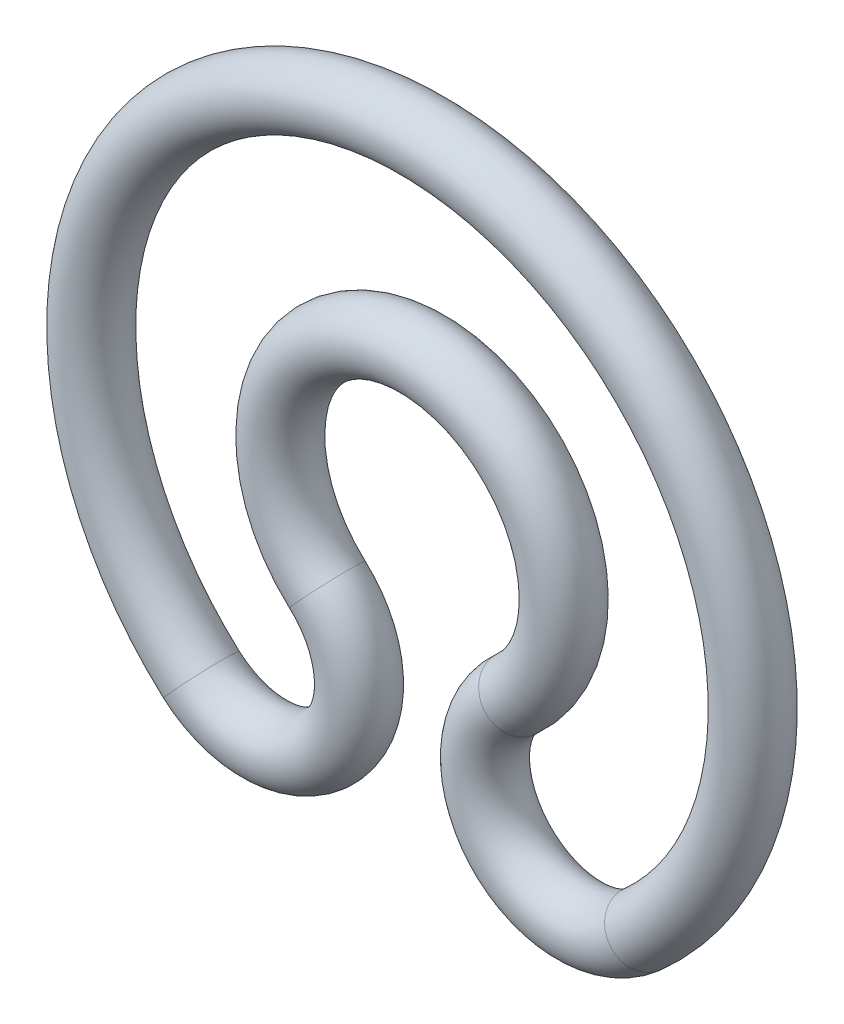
from build123d import *

# Parameters (mm, degrees)
ESQUISSE2_R = 0.5


with BuildPart() as part:
    # Balayage1: sweep along a path in Esquisse1
    with BuildLine(Plane.XY) as balayage1_path:
        ThreePointArc((1.5, -1.677050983), (0, 2.25), (-1.5, -1.677050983))
        ThreePointArc((-1.5, -1.677050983), (-1.381966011, -3.795084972), (-3.5, -3.913118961))
        ThreePointArc((-3.5, -3.913118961), (0, 5.25), (3.5, -3.913118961))
        ThreePointArc((3.5, -3.913118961), (1.381966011, -3.795084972), (1.5, -1.677050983))
    # Esquisse2 → Balayage1 (sweep)
    with BuildSketch(Plane(origin=(0, 0, 0), x_dir=(1, 0, 0), z_dir=(0, 1, 0))):
        with Locations((2.25, 0)):
            Circle(ESQUISSE2_R)
    sweep(path=balayage1_path.line)


solid = part.part
